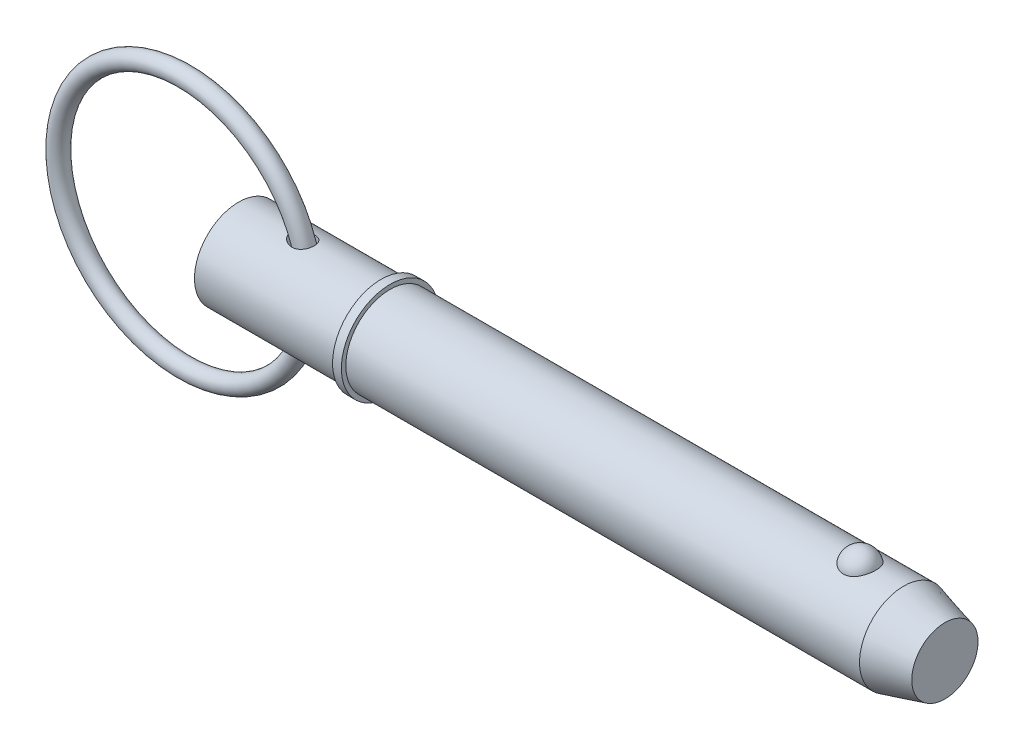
ISO-10303-21;
HEADER;
FILE_DESCRIPTION(('STEP AP214'),'2;1');
FILE_NAME('part.step','',(''),(''),'','','');
FILE_SCHEMA(('AUTOMOTIVE_DESIGN { 1 0 10303 214 1 1 1 1 }'));
ENDSEC;
DATA;
#1=APPLICATION_CONTEXT('core data for automotive mechanical design processes');
#2=APPLICATION_PROTOCOL_DEFINITION('international standard','automotive_design',2000,#1);
#3=PRODUCT_CONTEXT('',#1,'mechanical');
#4=PRODUCT('Part','Part','',(#3));
#5=PRODUCT_RELATED_PRODUCT_CATEGORY('part','',(#4));
#6=PRODUCT_DEFINITION_FORMATION('','',#4);
#7=PRODUCT_DEFINITION_CONTEXT('part definition',#1,'design');
#8=PRODUCT_DEFINITION('design','',#6,#7);
#9=PRODUCT_DEFINITION_SHAPE('','',#8);
#10=(LENGTH_UNIT() NAMED_UNIT(*) SI_UNIT(.MILLI.,.METRE.));
#11=(NAMED_UNIT(*) PLANE_ANGLE_UNIT() SI_UNIT($,.RADIAN.));
#12=(NAMED_UNIT(*) SI_UNIT($,.STERADIAN.) SOLID_ANGLE_UNIT());
#13=UNCERTAINTY_MEASURE_WITH_UNIT(LENGTH_MEASURE(1.E-05),#10,'distance_accuracy_value','');
#14=(GEOMETRIC_REPRESENTATION_CONTEXT(3) GLOBAL_UNCERTAINTY_ASSIGNED_CONTEXT((#13)) GLOBAL_UNIT_ASSIGNED_CONTEXT((#10,
#11,#12)) REPRESENTATION_CONTEXT('',''));
#15=CARTESIAN_POINT('',(0.,0.,0.));
#16=DIRECTION('',(0.,0.,1.));
#17=DIRECTION('',(1.,0.,0.));
#18=AXIS2_PLACEMENT_3D('',#15,#16,#17);
#19=CARTESIAN_POINT('',(-13.640845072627,0.,0.));
#20=DIRECTION('',(0.,0.,1.));
#21=DIRECTION('',(1.,0.,0.));
#22=AXIS2_PLACEMENT_3D('',#19,#20,#21);
#23=TOROIDAL_SURFACE('',#22,31.75,2.223);
#24=CARTESIAN_POINT('',(20.332154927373,0.,0.));
#25=VERTEX_POINT('',#24);
#26=VERTEX_LOOP('',#25);
#27=FACE_BOUND('',#26,.T.);
#28=ADVANCED_FACE('P0_F12',(#27),#23,.T.);
#29=CLOSED_SHELL('',(#28));
#30=MANIFOLD_SOLID_BREP('P0_B1',#29);
#31=CARTESIAN_POINT('',(0.,0.,0.));
#32=DIRECTION('',(1.,0.,0.));
#33=DIRECTION('',(0.,0.,-1.));
#34=AXIS2_PLACEMENT_3D('',#31,#32,#33);
#35=CYLINDRICAL_SURFACE('',#34,11.115);
#36=CARTESIAN_POINT('',(13.5245830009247,11.0328953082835,-1.34849772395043));
#37=CARTESIAN_POINT('',(13.6190616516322,11.0150940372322,-1.49413162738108));
#38=CARTESIAN_POINT('',(13.7272589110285,10.9954577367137,-1.63076546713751));
#39=CARTESIAN_POINT('',(13.9654537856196,10.9550099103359,-1.8834727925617));
#40=CARTESIAN_POINT('',(14.0954990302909,10.9341958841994,-1.99950019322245));
#41=CARTESIAN_POINT('',(14.3718600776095,10.893854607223,-2.20871939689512));
#42=CARTESIAN_POINT('',(14.5180879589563,10.8743212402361,-2.30202655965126));
#43=CARTESIAN_POINT('',(14.8233821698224,10.8385071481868,-2.46515115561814));
#44=CARTESIAN_POINT('',(14.9824448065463,10.8222254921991,-2.53497531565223));
#45=CARTESIAN_POINT('',(15.3233581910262,10.7936101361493,-2.65430007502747));
#46=CARTESIAN_POINT('',(15.5060064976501,10.7817126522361,-2.7016502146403));
#47=CARTESIAN_POINT('',(15.8771124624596,10.7657570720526,-2.76455948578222));
#48=CARTESIAN_POINT('',(16.0655695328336,10.7616981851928,-2.78012182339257));
#49=CARTESIAN_POINT('',(16.4345152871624,10.7624400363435,-2.77724928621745));
#50=CARTESIAN_POINT('',(16.6150121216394,10.7668823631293,-2.76018977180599));
#51=CARTESIAN_POINT('',(16.9695132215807,10.7837407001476,-2.69357457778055));
#52=CARTESIAN_POINT('',(17.1435222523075,10.7961507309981,-2.64404326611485));
#53=CARTESIAN_POINT('',(17.4621418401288,10.8258984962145,-2.51928348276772));
#54=CARTESIAN_POINT('',(17.6079677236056,10.8426430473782,-2.44700611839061));
#55=CARTESIAN_POINT('',(17.884162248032,10.8794194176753,-2.27791740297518));
#56=CARTESIAN_POINT('',(18.0145349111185,10.8994503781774,-2.18111245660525));
#57=CARTESIAN_POINT('',(18.2494965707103,10.9392822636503,-1.9713196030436));
#58=CARTESIAN_POINT('',(18.3550661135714,10.9590421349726,-1.85941863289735));
#59=CARTESIAN_POINT('',(18.5458147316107,10.9970986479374,-1.61919918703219));
#60=CARTESIAN_POINT('',(18.6309947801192,11.0153953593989,-1.49088149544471));
#61=CARTESIAN_POINT('',(18.7786686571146,11.0484675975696,-1.2218388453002));
#62=CARTESIAN_POINT('',(18.8412214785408,11.063252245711,-1.08114735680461));
#63=CARTESIAN_POINT('',(18.9425265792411,11.0877718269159,-0.791025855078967));
#64=CARTESIAN_POINT('',(18.9812780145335,11.0975065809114,-0.641595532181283));
#65=CARTESIAN_POINT('',(19.0343305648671,11.1109435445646,-0.336997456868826));
#66=CARTESIAN_POINT('',(19.0484404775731,11.1145985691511,-0.181794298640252));
#67=CARTESIAN_POINT('',(19.0513147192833,11.1153384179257,0.128864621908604));
#68=CARTESIAN_POINT('',(19.0400783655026,11.112423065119,0.284320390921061));
#69=CARTESIAN_POINT('',(18.9924362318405,11.1003163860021,0.591525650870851));
#70=CARTESIAN_POINT('',(18.9559600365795,11.0911075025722,0.743263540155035));
#71=CARTESIAN_POINT('',(18.858576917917,11.0673920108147,1.0382524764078));
#72=CARTESIAN_POINT('',(18.7976699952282,11.0528854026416,1.18150352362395));
#73=CARTESIAN_POINT('',(18.6529960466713,11.020201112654,1.45511394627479));
#74=CARTESIAN_POINT('',(18.5692772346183,11.0020311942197,1.58549973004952));
#75=CARTESIAN_POINT('',(18.3810003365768,10.9640237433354,1.82995492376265));
#76=CARTESIAN_POINT('',(18.2764441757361,10.9441863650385,1.94402583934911));
#77=CARTESIAN_POINT('',(18.0501398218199,10.9052267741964,2.15183128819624));
#78=CARTESIAN_POINT('',(17.9285270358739,10.8861003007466,2.24571250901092));
#79=CARTESIAN_POINT('',(17.6709592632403,10.8505244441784,2.41175942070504));
#80=CARTESIAN_POINT('',(17.5350055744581,10.8340748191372,2.48392707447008));
#81=CARTESIAN_POINT('',(17.2528390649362,10.8056099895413,2.60497667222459));
#82=CARTESIAN_POINT('',(17.1066353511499,10.7935909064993,2.65387899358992));
#83=CARTESIAN_POINT('',(16.8080326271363,10.7750969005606,2.72799859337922));
#84=CARTESIAN_POINT('',(16.6556326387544,10.7686228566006,2.75321211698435));
#85=CARTESIAN_POINT('',(16.3428877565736,10.761517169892,2.78086153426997));
#86=CARTESIAN_POINT('',(16.1824599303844,10.7611149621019,2.78240297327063));
#87=CARTESIAN_POINT('',(15.863296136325,10.766478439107,2.76156874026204));
#88=CARTESIAN_POINT('',(15.7045607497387,10.7722461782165,2.73918510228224));
#89=CARTESIAN_POINT('',(15.3787211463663,10.7898500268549,2.66904167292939));
#90=CARTESIAN_POINT('',(15.2120794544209,10.8021675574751,2.61925575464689));
#91=CARTESIAN_POINT('',(14.8886284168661,10.8315482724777,2.49496357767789));
#92=CARTESIAN_POINT('',(14.731827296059,10.8486153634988,2.42043695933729));
#93=CARTESIAN_POINT('',(14.4198762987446,10.8870804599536,2.24137362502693));
#94=CARTESIAN_POINT('',(14.2658484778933,10.9087148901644,2.13492229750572));
#95=CARTESIAN_POINT('',(13.9788214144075,10.9526299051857,1.89676517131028));
#96=CARTESIAN_POINT('',(13.8458041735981,10.9749099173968,1.76508120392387));
#97=CARTESIAN_POINT('',(13.6310853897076,11.012885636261,1.50762337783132));
#98=CARTESIAN_POINT('',(13.5444453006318,11.0290026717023,1.38602082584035));
#99=CARTESIAN_POINT('',(13.392158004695,11.0581740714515,1.12983363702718));
#100=CARTESIAN_POINT('',(13.3264946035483,11.0712307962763,0.995259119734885));
#101=CARTESIAN_POINT('',(13.2464179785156,11.0874250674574,0.785640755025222));
#102=CARTESIAN_POINT('',(13.2227369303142,11.0922707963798,0.714166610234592));
#103=CARTESIAN_POINT('',(13.1820656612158,11.1006486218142,0.569277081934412));
#104=CARTESIAN_POINT('',(13.1650721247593,11.1041813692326,0.495862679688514));
#105=CARTESIAN_POINT('',(13.1381118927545,11.1098070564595,0.347711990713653));
#106=CARTESIAN_POINT('',(13.1281436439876,11.1119003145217,0.272975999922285));
#107=CARTESIAN_POINT('',(13.1154243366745,11.1145746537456,0.122890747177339));
#108=CARTESIAN_POINT('',(13.1126723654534,11.1151559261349,0.0475415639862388));
#109=CARTESIAN_POINT('',(13.115160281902,11.1146296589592,-0.160384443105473));
#110=CARTESIAN_POINT('',(13.128061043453,11.111903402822,-0.292944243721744));
#111=CARTESIAN_POINT('',(13.175691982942,11.1019662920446,-0.553751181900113));
#112=CARTESIAN_POINT('',(13.2104121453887,11.094757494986,-0.682000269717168));
#113=CARTESIAN_POINT('',(13.2891255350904,11.0787645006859,-0.901873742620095));
#114=CARTESIAN_POINT('',(13.3290466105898,11.0707438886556,-0.995044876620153));
#115=CARTESIAN_POINT('',(13.4192915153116,11.0529876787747,-1.17599209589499));
#116=CARTESIAN_POINT('',(13.4696154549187,11.0432520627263,-1.26376812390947));
#117=CARTESIAN_POINT('',(13.5245830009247,11.0328953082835,-1.34849772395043));
#118=B_SPLINE_CURVE_WITH_KNOTS('',3,(#36,#37,#38,#39,#40,#41,#42,#43,#44,#45,#46,#47,#48,#49,
#50,#51,#52,#53,#54,#55,#56,#57,#58,#59,#60,#61,#62,#63,#64,#65,#66,#67,#68,#69,#70,#71,#72,#73,
#74,#75,#76,#77,#78,#79,#80,#81,#82,#83,#84,#85,#86,#87,#88,#89,#90,#91,#92,#93,#94,#95,#96,#97,
#98,#99,#100,#101,#102,#103,#104,#105,#106,#107,#108,#109,#110,#111,#112,#113,#114,#115,#116,
#117),.UNSPECIFIED.,.T.,.F.,(4,2,2,2,2,2,2,2,2,2,2,2,2,2,2,2,2,2,2,2,2,2,2,2,2,2,2,2,2,2,2,2,2,
2,2,2,2,2,2,2,4),(0.,0.52309976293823,1.04735506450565,1.56889024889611,2.09027590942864,
2.65465173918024,3.21897064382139,3.76002078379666,4.30066536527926,4.78898318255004,
5.27717362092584,5.74028268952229,6.20336964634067,6.665240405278,7.12712754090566,
7.59258295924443,8.05805091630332,8.52482272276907,8.99159451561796,9.45738731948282,
9.9231371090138,10.3853792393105,10.8475795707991,11.3093743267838,11.7712422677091,
12.2505208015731,12.7299589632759,13.2508366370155,13.7721440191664,14.334890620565,
14.8971525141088,15.3459336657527,15.7943675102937,16.0204422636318,16.2464047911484,
16.4723173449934,16.6982013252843,17.095711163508,17.4930386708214,17.7973741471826,
18.1017128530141),.UNSPECIFIED.);
#119=CARTESIAN_POINT('',(13.5245830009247,11.0328953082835,-1.34849772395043));
#120=VERTEX_POINT('',#119);
#121=EDGE_CURVE('P1_E42',#120,#120,#118,.T.);
#122=ORIENTED_EDGE('',*,*,#121,.T.);
#123=EDGE_LOOP('',(#122));
#124=FACE_BOUND('',#123,.T.);
#125=CARTESIAN_POINT('',(0.,0.,0.));
#126=DIRECTION('',(1.,0.,0.));
#127=DIRECTION('',(0.,0.,-1.));
#128=AXIS2_PLACEMENT_3D('',#125,#126,#127);
#129=CIRCLE('',#128,11.115);
#130=CARTESIAN_POINT('',(0.,0.,-11.115));
#131=VERTEX_POINT('',#130);
#132=EDGE_CURVE('P1_E9',#131,#131,#129,.T.);
#133=ORIENTED_EDGE('',*,*,#132,.T.);
#134=EDGE_LOOP('',(#133));
#135=FACE_BOUND('',#134,.T.);
#136=CARTESIAN_POINT('',(35.877,0.,0.));
#137=DIRECTION('',(1.,0.,0.));
#138=DIRECTION('',(0.,0.,-1.));
#139=AXIS2_PLACEMENT_3D('',#136,#137,#138);
#140=CIRCLE('',#139,11.115);
#141=CARTESIAN_POINT('',(35.877,0.,-11.115));
#142=VERTEX_POINT('',#141);
#143=EDGE_CURVE('P1_E25',#142,#142,#140,.T.);
#144=ORIENTED_EDGE('',*,*,#143,.F.);
#145=EDGE_LOOP('',(#144));
#146=FACE_BOUND('',#145,.T.);
#147=CARTESIAN_POINT('',(13.5245830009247,-11.0328953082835,-1.34849772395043));
#148=CARTESIAN_POINT('',(13.449887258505,-11.0469690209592,-1.233356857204));
#149=CARTESIAN_POINT('',(13.3837464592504,-11.0598986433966,-1.11255897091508));
#150=CARTESIAN_POINT('',(13.271526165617,-11.0822620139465,-0.861680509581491));
#151=CARTESIAN_POINT('',(13.2254273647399,-11.0916991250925,-0.731609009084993));
#152=CARTESIAN_POINT('',(13.1557497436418,-11.1060943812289,-0.464578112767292));
#153=CARTESIAN_POINT('',(13.1322820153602,-11.111030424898,-0.327588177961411));
#154=CARTESIAN_POINT('',(13.1098958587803,-11.1157368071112,-0.0515139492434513));
#155=CARTESIAN_POINT('',(13.1109730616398,-11.1155080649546,0.0875699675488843));
#156=CARTESIAN_POINT('',(13.1367722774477,-11.110088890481,0.354927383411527));
#157=CARTESIAN_POINT('',(13.160070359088,-11.1051972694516,0.483348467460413));
#158=CARTESIAN_POINT('',(13.2268311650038,-11.091413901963,0.734581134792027));
#159=CARTESIAN_POINT('',(13.2702981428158,-11.0825213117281,0.857391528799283));
#160=CARTESIAN_POINT('',(13.3769008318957,-11.0612491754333,1.09871322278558));
#161=CARTESIAN_POINT('',(13.4406446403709,-11.048763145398,1.21694419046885));
#162=CARTESIAN_POINT('',(13.5844860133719,-11.0215642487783,1.44267020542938));
#163=CARTESIAN_POINT('',(13.6645903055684,-11.0068504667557,1.55016080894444));
#164=CARTESIAN_POINT('',(13.8511803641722,-10.9741237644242,1.76795565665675));
#165=CARTESIAN_POINT('',(13.959808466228,-10.9559422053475,1.87639683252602));
#166=CARTESIAN_POINT('',(14.1916437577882,-10.9197998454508,2.07642617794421));
#167=CARTESIAN_POINT('',(14.3148607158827,-10.901839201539,2.16800294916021));
#168=CARTESIAN_POINT('',(14.5931107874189,-10.8649902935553,2.34622033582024));
#169=CARTESIAN_POINT('',(14.7501095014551,-10.8463937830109,2.42986679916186));
#170=CARTESIAN_POINT('',(15.0757118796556,-10.8136392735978,2.57171975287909));
#171=CARTESIAN_POINT('',(15.2443214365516,-10.7994835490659,2.62991321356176));
#172=CARTESIAN_POINT('',(15.599068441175,-10.7767894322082,2.72147498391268));
#173=CARTESIAN_POINT('',(15.7856559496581,-10.768622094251,2.75321798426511));
#174=CARTESIAN_POINT('',(16.1617095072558,-10.7608206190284,2.78356776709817));
#175=CARTESIAN_POINT('',(16.3511739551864,-10.7611818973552,2.78219235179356));
#176=CARTESIAN_POINT('',(16.7138126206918,-10.7705428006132,2.7457129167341));
#177=CARTESIAN_POINT('',(16.8872269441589,-10.7789612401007,2.71287798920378));
#178=CARTESIAN_POINT('',(17.2247245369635,-10.8028011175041,2.61632772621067));
#179=CARTESIAN_POINT('',(17.3888134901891,-10.8182182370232,2.55263143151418));
#180=CARTESIAN_POINT('',(17.6871641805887,-10.8524191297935,2.40281428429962));
#181=CARTESIAN_POINT('',(17.8227812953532,-10.8707652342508,2.31928155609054));
#182=CARTESIAN_POINT('',(18.0770765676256,-10.9094513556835,2.12988301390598));
#183=CARTESIAN_POINT('',(18.1957578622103,-10.9297910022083,2.0240213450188));
#184=CARTESIAN_POINT('',(18.4088055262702,-10.9693230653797,1.79719870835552));
#185=CARTESIAN_POINT('',(18.5038890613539,-10.9885305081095,1.67691225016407));
#186=CARTESIAN_POINT('',(18.6726701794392,-11.0244347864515,1.42183894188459));
#187=CARTESIAN_POINT('',(18.7463681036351,-11.0411316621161,1.28705232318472));
#188=CARTESIAN_POINT('',(18.8708297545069,-11.0702507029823,1.00634471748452));
#189=CARTESIAN_POINT('',(18.9215212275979,-11.0826593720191,0.860390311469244));
#190=CARTESIAN_POINT('',(18.9984973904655,-11.1017993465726,0.561823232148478));
#191=CARTESIAN_POINT('',(19.0247811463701,-11.1085304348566,0.409210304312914));
#192=CARTESIAN_POINT('',(19.0524622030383,-11.1156244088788,0.100537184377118));
#193=CARTESIAN_POINT('',(19.0536873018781,-11.1159432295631,-0.0555394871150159));
#194=CARTESIAN_POINT('',(19.0307837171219,-11.110065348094,-0.365700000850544));
#195=CARTESIAN_POINT('',(19.0066544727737,-11.1038685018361,-0.519783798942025));
#196=CARTESIAN_POINT('',(18.9335163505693,-11.0856111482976,-0.821817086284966));
#197=CARTESIAN_POINT('',(18.88447016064,-11.0735418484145,-0.969757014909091));
#198=CARTESIAN_POINT('',(18.7625929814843,-11.0448501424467,-1.25502066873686));
#199=CARTESIAN_POINT('',(18.6897623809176,-11.0282278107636,-1.39234456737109));
#200=CARTESIAN_POINT('',(18.522359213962,-10.9923333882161,-1.65195905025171));
#201=CARTESIAN_POINT('',(18.427863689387,-10.9730707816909,-1.77430060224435));
#202=CARTESIAN_POINT('',(18.2194216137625,-10.9340072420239,-2.00099176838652));
#203=CARTESIAN_POINT('',(18.1054772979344,-10.9142063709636,-2.10534344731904));
#204=CARTESIAN_POINT('',(17.8622613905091,-10.8764452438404,-2.2924289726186));
#205=CARTESIAN_POINT('',(17.7331196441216,-10.8584715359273,-2.3753290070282));
#206=CARTESIAN_POINT('',(17.4625069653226,-10.8261386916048,-2.51860389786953));
#207=CARTESIAN_POINT('',(17.3210365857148,-10.8117793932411,-2.57897976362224));
#208=CARTESIAN_POINT('',(17.0290309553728,-10.7880576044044,-2.67648805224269));
#209=CARTESIAN_POINT('',(16.8784484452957,-10.7787241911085,-2.71348542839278));
#210=CARTESIAN_POINT('',(16.573148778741,-10.7659618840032,-2.7636855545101));
#211=CARTESIAN_POINT('',(16.4184306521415,-10.7625343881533,-2.77688267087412));
#212=CARTESIAN_POINT('',(16.1008073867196,-10.761643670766,-2.78033419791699));
#213=CARTESIAN_POINT('',(15.9378898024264,-10.7644957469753,-2.76937572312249));
#214=CARTESIAN_POINT('',(15.6157286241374,-10.7762062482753,-2.72344300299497));
#215=CARTESIAN_POINT('',(15.4564861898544,-10.7850665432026,-2.68846128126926));
#216=CARTESIAN_POINT('',(15.1305734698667,-10.808737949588,-2.59174021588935));
#217=CARTESIAN_POINT('',(14.9645834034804,-10.8240246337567,-2.52782071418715));
#218=CARTESIAN_POINT('',(14.6448218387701,-10.8585969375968,-2.37491543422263));
#219=CARTESIAN_POINT('',(14.4910653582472,-10.8778873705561,-2.28589943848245));
#220=CARTESIAN_POINT('',(14.1837929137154,-10.920550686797,-2.07312951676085));
#221=CARTESIAN_POINT('',(14.0321999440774,-10.9441390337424,-1.94661563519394));
#222=CARTESIAN_POINT('',(13.756115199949,-10.9902311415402,-1.66673537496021));
#223=CARTESIAN_POINT('',(13.6315733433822,-11.0127368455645,-1.51341958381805));
#224=CARTESIAN_POINT('',(13.5245830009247,-11.0328953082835,-1.34849772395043));
#225=B_SPLINE_CURVE_WITH_KNOTS('',3,(#147,#148,#149,#150,#151,#152,#153,#154,#155,#156,#157,
#158,#159,#160,#161,#162,#163,#164,#165,#166,#167,#168,#169,#170,#171,#172,#173,#174,#175,#176,
#177,#178,#179,#180,#181,#182,#183,#184,#185,#186,#187,#188,#189,#190,#191,#192,#193,#194,#195,
#196,#197,#198,#199,#200,#201,#202,#203,#204,#205,#206,#207,#208,#209,#210,#211,#212,#213,#214,
#215,#216,#217,#218,#219,#220,#221,#222,#223,#224),.UNSPECIFIED.,.T.,.F.,(4,2,2,2,2,2,2,2,2,2,2,
2,2,2,2,2,2,2,2,2,2,2,2,2,2,2,2,2,2,2,2,2,2,2,2,2,2,2,4),(0.,0.4133945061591,0.8263899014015,
1.24140245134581,1.65634113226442,2.04635967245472,2.43646050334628,2.83958259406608,
3.24287078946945,3.70479277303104,4.16702582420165,4.70130512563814,5.23585761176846,
5.80123945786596,6.36631739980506,6.89348344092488,7.42032464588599,7.8989135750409,
8.37741373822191,8.83881993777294,9.30021877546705,9.76305681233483,10.2259125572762,
10.6919479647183,11.1579936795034,11.6247393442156,12.0914773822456,12.55658073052,
13.0216306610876,13.4829619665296,13.9442725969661,14.408224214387,14.8722856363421,
15.3601762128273,15.8482186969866,16.3815107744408,16.9154477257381,17.5086806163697,
18.1008056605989),.UNSPECIFIED.);
#226=CARTESIAN_POINT('',(13.5245830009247,-11.0328953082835,-1.34849772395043));
#227=VERTEX_POINT('',#226);
#228=EDGE_CURVE('P1_E17',#227,#227,#225,.T.);
#229=ORIENTED_EDGE('',*,*,#228,.T.);
#230=EDGE_LOOP('',(#229));
#231=FACE_BOUND('',#230,.T.);
#232=ADVANCED_FACE('P1_F13',(#124,#135,#146,#231),#35,.T.);
#233=CARTESIAN_POINT('',(0.,0.,0.));
#234=DIRECTION('',(1.,0.,0.));
#235=DIRECTION('',(0.,0.,-1.));
#236=AXIS2_PLACEMENT_3D('',#233,#234,#235);
#237=CYLINDRICAL_SURFACE('',#236,11.115);
#238=CARTESIAN_POINT('',(167.429563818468,0.,0.));
#239=DIRECTION('',(1.,0.,0.));
#240=DIRECTION('',(0.,0.,-1.));
#241=AXIS2_PLACEMENT_3D('',#238,#239,#240);
#242=CIRCLE('',#241,11.115);
#243=CARTESIAN_POINT('',(167.429563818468,0.,-11.115));
#244=VERTEX_POINT('',#243);
#245=EDGE_CURVE('P1_E99',#244,#244,#242,.T.);
#246=ORIENTED_EDGE('',*,*,#245,.F.);
#247=EDGE_LOOP('',(#246));
#248=FACE_BOUND('',#247,.T.);
#249=CARTESIAN_POINT('',(38.1,0.,0.));
#250=DIRECTION('',(1.,0.,0.));
#251=DIRECTION('',(0.,0.,-1.));
#252=AXIS2_PLACEMENT_3D('',#249,#250,#251);
#253=CIRCLE('',#252,11.115);
#254=CARTESIAN_POINT('',(38.1,0.,-11.115));
#255=VERTEX_POINT('',#254);
#256=EDGE_CURVE('P1_E96',#255,#255,#253,.T.);
#257=ORIENTED_EDGE('',*,*,#256,.T.);
#258=EDGE_LOOP('',(#257));
#259=FACE_BOUND('',#258,.T.);
#260=CARTESIAN_POINT('',(156.431068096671,10.3028087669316,4.17077409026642));
#261=CARTESIAN_POINT('',(156.214775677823,10.3028003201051,4.17078240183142));
#262=CARTESIAN_POINT('',(155.998548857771,10.3098895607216,4.1534059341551));
#263=CARTESIAN_POINT('',(155.572540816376,10.3373834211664,4.08449540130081));
#264=CARTESIAN_POINT('',(155.362757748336,10.3577841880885,4.03297121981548));
#265=CARTESIAN_POINT('',(154.955782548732,10.4095237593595,3.89746513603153));
#266=CARTESIAN_POINT('',(154.758572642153,10.4408466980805,3.81353029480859));
#267=CARTESIAN_POINT('',(154.381338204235,10.5110236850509,3.61560339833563));
#268=CARTESIAN_POINT('',(154.201317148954,10.5498792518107,3.50160528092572));
#269=CARTESIAN_POINT('',(153.857684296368,10.6322884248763,3.2429246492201));
#270=CARTESIAN_POINT('',(153.694686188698,10.6759443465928,3.09746040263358));
#271=CARTESIAN_POINT('',(153.394591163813,10.7625291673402,2.78171925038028));
#272=CARTESIAN_POINT('',(153.257499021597,10.8054579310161,2.61143778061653));
#273=CARTESIAN_POINT('',(153.006408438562,10.8881935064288,2.24226695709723));
#274=CARTESIAN_POINT('',(152.893710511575,10.9277761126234,2.04244123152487));
#275=CARTESIAN_POINT('',(152.701777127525,10.997484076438,1.62578254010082));
#276=CARTESIAN_POINT('',(152.622544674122,11.0276085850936,1.40894804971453));
#277=CARTESIAN_POINT('',(152.498303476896,11.0756732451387,0.961250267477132));
#278=CARTESIAN_POINT('',(152.453760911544,11.0934470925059,0.730239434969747));
#279=CARTESIAN_POINT('',(152.401569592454,11.1143331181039,0.263439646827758));
#280=CARTESIAN_POINT('',(152.393920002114,11.1174456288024,0.0276507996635));
#281=CARTESIAN_POINT('',(152.41561056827,11.1087161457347,-0.440729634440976));
#282=CARTESIAN_POINT('',(152.444762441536,11.0969502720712,-0.673331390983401));
#283=CARTESIAN_POINT('',(152.539143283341,11.0597872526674,-1.12996621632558));
#284=CARTESIAN_POINT('',(152.604372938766,11.0343898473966,-1.35399912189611));
#285=CARTESIAN_POINT('',(152.76969844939,10.972515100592,-1.78750286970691));
#286=CARTESIAN_POINT('',(152.86983863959,10.9360236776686,-1.99695478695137));
#287=CARTESIAN_POINT('',(153.102940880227,10.855759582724,-2.39520667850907));
#288=CARTESIAN_POINT('',(153.235905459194,10.8119863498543,-2.58400506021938));
#289=CARTESIAN_POINT('',(153.532407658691,10.7216733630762,-2.93635726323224));
#290=CARTESIAN_POINT('',(153.696056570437,10.675123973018,-3.09981510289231));
#291=CARTESIAN_POINT('',(154.049860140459,10.5846571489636,-3.3959224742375));
#292=CARTESIAN_POINT('',(154.240012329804,10.5407394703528,-3.52857487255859));
#293=CARTESIAN_POINT('',(154.63750141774,10.4616690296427,-3.7564605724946));
#294=CARTESIAN_POINT('',(154.84436705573,10.4263443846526,-3.85245432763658));
#295=CARTESIAN_POINT('',(155.272954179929,10.3675574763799,-4.00798747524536));
#296=CARTESIAN_POINT('',(155.494670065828,10.344090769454,-4.06754052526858));
#297=CARTESIAN_POINT('',(155.934669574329,10.3128282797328,-4.14614314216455));
#298=CARTESIAN_POINT('',(156.152565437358,10.3043040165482,-4.16707833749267));
#299=CARTESIAN_POINT('',(156.58894951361,10.3016771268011,-4.17357158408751));
#300=CARTESIAN_POINT('',(156.807437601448,10.3075716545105,-4.159136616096));
#301=CARTESIAN_POINT('',(157.231744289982,10.3326686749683,-4.0963696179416));
#302=CARTESIAN_POINT('',(157.437745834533,10.3514555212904,-4.04909574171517));
#303=CARTESIAN_POINT('',(157.838576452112,10.399818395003,-3.92320197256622));
#304=CARTESIAN_POINT('',(158.0334046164,10.4293952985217,-3.84457953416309));
#305=CARTESIAN_POINT('',(158.411191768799,10.4969600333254,-3.6561241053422));
#306=CARTESIAN_POINT('',(158.593797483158,10.5351178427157,-3.54564545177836));
#307=CARTESIAN_POINT('',(158.938204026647,10.6154999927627,-3.29718036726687));
#308=CARTESIAN_POINT('',(159.100000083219,10.657725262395,-3.1591876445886));
#309=CARTESIAN_POINT('',(159.406959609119,10.744212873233,-2.85163580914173));
#310=CARTESIAN_POINT('',(159.550891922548,10.7884718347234,-2.68084605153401));
#311=CARTESIAN_POINT('',(159.809237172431,10.872374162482,-2.3172186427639));
#312=CARTESIAN_POINT('',(159.923644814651,10.9120167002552,-2.12437704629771));
#313=CARTESIAN_POINT('',(160.123873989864,10.9838919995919,-1.71516999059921));
#314=CARTESIAN_POINT('',(160.20866178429,11.0158465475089,-1.498248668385));
#315=CARTESIAN_POINT('',(160.34268382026,11.0673523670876,-1.052285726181));
#316=CARTESIAN_POINT('',(160.391917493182,11.086903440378,-0.823243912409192));
#317=CARTESIAN_POINT('',(160.453891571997,11.1116323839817,-0.359087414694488));
#318=CARTESIAN_POINT('',(160.466566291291,11.1167843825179,-0.123962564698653));
#319=CARTESIAN_POINT('',(160.454973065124,11.1121144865,0.34522049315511));
#320=CARTESIAN_POINT('',(160.430705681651,11.1022928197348,0.579278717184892));
#321=CARTESIAN_POINT('',(160.345907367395,11.0687504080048,1.03866534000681));
#322=CARTESIAN_POINT('',(160.285529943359,11.0450885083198,1.26402641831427));
#323=CARTESIAN_POINT('',(160.129853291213,10.9863185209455,1.70076772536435));
#324=CARTESIAN_POINT('',(160.034551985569,10.9512097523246,1.91214712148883));
#325=CARTESIAN_POINT('',(159.810397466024,10.8729733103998,2.31608359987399));
#326=CARTESIAN_POINT('',(159.681380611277,10.8298068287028,2.50854240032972));
#327=CARTESIAN_POINT('',(159.392732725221,10.7401896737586,2.86808766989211));
#328=CARTESIAN_POINT('',(159.233102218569,10.6937390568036,3.03517457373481));
#329=CARTESIAN_POINT('',(158.887534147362,10.6029321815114,3.33857581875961));
#330=CARTESIAN_POINT('',(158.701708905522,10.5585680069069,3.47501541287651));
#331=CARTESIAN_POINT('',(158.307875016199,10.4769321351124,3.71390897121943));
#332=CARTESIAN_POINT('',(158.099863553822,10.439661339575,3.81635861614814));
#333=CARTESIAN_POINT('',(157.654066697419,10.3749407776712,3.98910631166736));
#334=CARTESIAN_POINT('',(157.415234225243,10.3482457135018,4.05700929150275));
#335=CARTESIAN_POINT('',(156.927925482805,10.312188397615,4.14782844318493));
#336=CARTESIAN_POINT('',(156.679453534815,10.3028184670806,4.1707645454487));
#337=CARTESIAN_POINT('',(156.431068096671,10.3028087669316,4.17077409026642));
#338=B_SPLINE_CURVE_WITH_KNOTS('',3,(#260,#261,#262,#263,#264,#265,#266,#267,#268,#269,#270,
#271,#272,#273,#274,#275,#276,#277,#278,#279,#280,#281,#282,#283,#284,#285,#286,#287,#288,#289,
#290,#291,#292,#293,#294,#295,#296,#297,#298,#299,#300,#301,#302,#303,#304,#305,#306,#307,#308,
#309,#310,#311,#312,#313,#314,#315,#316,#317,#318,#319,#320,#321,#322,#323,#324,#325,#326,#327,
#328,#329,#330,#331,#332,#333,#334,#335,#336,#337),.UNSPECIFIED.,.T.,.F.,(4,2,2,2,2,2,2,2,2,2,2,
2,2,2,2,2,2,2,2,2,2,2,2,2,2,2,2,2,2,2,2,2,2,2,2,2,2,2,4),(0.,0.647966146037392,1.29574482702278,
1.9425864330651,2.58955857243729,3.25496465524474,3.9204932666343,4.6156636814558,
5.31089647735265,6.01531821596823,6.71972398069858,7.42054043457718,8.12137023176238,
8.82309331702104,9.52487047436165,10.2292439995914,10.9335519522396,11.6223330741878,
12.31085589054,12.96476640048,13.618547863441,14.2521847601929,14.8858731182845,
15.5334360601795,16.1811472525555,16.8611459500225,17.5412664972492,18.2431855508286,
18.9451158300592,19.6483065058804,20.3514864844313,21.0516982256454,21.7519516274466,
22.4556690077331,23.1593743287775,23.8601491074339,24.561012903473,25.3054529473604,
26.0495629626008),.UNSPECIFIED.);
#339=CARTESIAN_POINT('',(156.431068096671,10.3028087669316,4.17077409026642));
#340=VERTEX_POINT('',#339);
#341=EDGE_CURVE('P1_E34',#340,#340,#338,.T.);
#342=ORIENTED_EDGE('',*,*,#341,.T.);
#343=EDGE_LOOP('',(#342));
#344=FACE_BOUND('',#343,.T.);
#345=ADVANCED_FACE('P1_F46',(#248,#259,#344),#237,.T.);
#346=CARTESIAN_POINT('',(0.,0.,0.));
#347=DIRECTION('',(-1.,0.,0.));
#348=DIRECTION('',(0.,0.,1.));
#349=AXIS2_PLACEMENT_3D('',#346,#347,#348);
#350=PLANE('',#349);
#351=ORIENTED_EDGE('',*,*,#132,.F.);
#352=EDGE_LOOP('',(#351));
#353=FACE_BOUND('',#352,.T.);
#354=ADVANCED_FACE('P1_F15',(#353),#350,.T.);
#355=CARTESIAN_POINT('',(35.877,11.115,0.));
#356=DIRECTION('',(-1.,0.,0.));
#357=DIRECTION('',(0.,0.,1.));
#358=AXIS2_PLACEMENT_3D('',#355,#356,#357);
#359=PLANE('',#358);
#360=ORIENTED_EDGE('',*,*,#143,.T.);
#361=EDGE_LOOP('',(#360));
#362=FACE_BOUND('',#361,.T.);
#363=CARTESIAN_POINT('',(35.877,0.,0.));
#364=DIRECTION('',(1.,0.,0.));
#365=DIRECTION('',(0.,0.,-1.));
#366=AXIS2_PLACEMENT_3D('',#363,#364,#365);
#367=CIRCLE('',#366,12.2265);
#368=CARTESIAN_POINT('',(35.877,0.,-12.2265));
#369=VERTEX_POINT('',#368);
#370=EDGE_CURVE('P1_E30',#369,#369,#367,.T.);
#371=ORIENTED_EDGE('',*,*,#370,.F.);
#372=EDGE_LOOP('',(#371));
#373=FACE_BOUND('',#372,.T.);
#374=ADVANCED_FACE('P1_F81',(#362,#373),#359,.T.);
#375=CARTESIAN_POINT('',(0.,0.,0.));
#376=DIRECTION('',(1.,0.,0.));
#377=DIRECTION('',(0.,0.,-1.));
#378=AXIS2_PLACEMENT_3D('',#375,#376,#377);
#379=CYLINDRICAL_SURFACE('',#378,12.2265);
#380=ORIENTED_EDGE('',*,*,#370,.T.);
#381=EDGE_LOOP('',(#380));
#382=FACE_BOUND('',#381,.T.);
#383=CARTESIAN_POINT('',(38.1,0.,0.));
#384=DIRECTION('',(1.,0.,0.));
#385=DIRECTION('',(0.,0.,-1.));
#386=AXIS2_PLACEMENT_3D('',#383,#384,#385);
#387=CIRCLE('',#386,12.2265);
#388=CARTESIAN_POINT('',(38.1,0.,-12.2265));
#389=VERTEX_POINT('',#388);
#390=EDGE_CURVE('P1_E95',#389,#389,#387,.T.);
#391=ORIENTED_EDGE('',*,*,#390,.F.);
#392=EDGE_LOOP('',(#391));
#393=FACE_BOUND('',#392,.T.);
#394=ADVANCED_FACE('P1_F68',(#382,#393),#379,.T.);
#395=CARTESIAN_POINT('',(38.1,12.2265,0.));
#396=DIRECTION('',(1.,0.,0.));
#397=DIRECTION('',(0.,0.,-1.));
#398=AXIS2_PLACEMENT_3D('',#395,#396,#397);
#399=PLANE('',#398);
#400=ORIENTED_EDGE('',*,*,#390,.T.);
#401=EDGE_LOOP('',(#400));
#402=FACE_BOUND('',#401,.T.);
#403=ORIENTED_EDGE('',*,*,#256,.F.);
#404=EDGE_LOOP('',(#403));
#405=FACE_BOUND('',#404,.T.);
#406=ADVANCED_FACE('P1_F62',(#402,#405),#399,.T.);
#407=CARTESIAN_POINT('',(177.8,0.,0.));
#408=DIRECTION('',(-1.,0.,0.));
#409=DIRECTION('',(0.,0.,1.));
#410=AXIS2_PLACEMENT_3D('',#407,#408,#409);
#411=CONICAL_SURFACE('',#410,8.33625000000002,0.26179938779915);
#412=ORIENTED_EDGE('',*,*,#245,.T.);
#413=EDGE_LOOP('',(#412));
#414=FACE_BOUND('',#413,.T.);
#415=CARTESIAN_POINT('',(177.8,0.,0.));
#416=DIRECTION('',(1.,0.,0.));
#417=DIRECTION('',(0.,0.,-1.));
#418=AXIS2_PLACEMENT_3D('',#415,#416,#417);
#419=CIRCLE('',#418,8.33625000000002);
#420=CARTESIAN_POINT('',(177.8,0.,-8.33625000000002));
#421=VERTEX_POINT('',#420);
#422=EDGE_CURVE('P1_E41',#421,#421,#419,.T.);
#423=ORIENTED_EDGE('',*,*,#422,.F.);
#424=EDGE_LOOP('',(#423));
#425=FACE_BOUND('',#424,.T.);
#426=ADVANCED_FACE('P1_F59',(#414,#425),#411,.T.);
#427=CARTESIAN_POINT('',(177.8,8.33625000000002,0.));
#428=DIRECTION('',(1.,0.,0.));
#429=DIRECTION('',(0.,0.,-1.));
#430=AXIS2_PLACEMENT_3D('',#427,#428,#429);
#431=PLANE('',#430);
#432=ORIENTED_EDGE('',*,*,#422,.T.);
#433=EDGE_LOOP('',(#432));
#434=FACE_BOUND('',#433,.T.);
#435=ADVANCED_FACE('P1_F55',(#434),#431,.T.);
#436=CARTESIAN_POINT('',(156.431068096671,10.0035,0.));
#437=DIRECTION('',(-1.,0.,0.));
#438=DIRECTION('',(0.,1.,0.));
#439=AXIS2_PLACEMENT_3D('',#436,#437,#438);
#440=SPHERICAL_SURFACE('',#439,4.18149999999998);
#441=ORIENTED_EDGE('',*,*,#341,.F.);
#442=EDGE_LOOP('',(#441));
#443=FACE_BOUND('',#442,.T.);
#444=ADVANCED_FACE('P1_F50',(#443),#440,.T.);
#445=CARTESIAN_POINT('',(-13.640845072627,0.,0.));
#446=DIRECTION('',(0.,0.,1.));
#447=DIRECTION('',(1.,0.,0.));
#448=AXIS2_PLACEMENT_3D('',#445,#446,#447);
#449=TOROIDAL_SURFACE('',#448,31.75,2.77875);
#450=ORIENTED_EDGE('',*,*,#228,.F.);
#451=EDGE_LOOP('',(#450));
#452=FACE_BOUND('',#451,.T.);
#453=ORIENTED_EDGE('',*,*,#121,.F.);
#454=EDGE_LOOP('',(#453));
#455=FACE_BOUND('',#454,.T.);
#456=ADVANCED_FACE('P1_F54',(#452,#455),#449,.F.);
#457=CLOSED_SHELL('',(#232,#345,#354,#374,#394,#406,#426,#435,#444,#456));
#458=MANIFOLD_SOLID_BREP('P1_B1',#457);
#459=ADVANCED_BREP_SHAPE_REPRESENTATION('',(#18,#30,#458),#14);
#460=SHAPE_DEFINITION_REPRESENTATION(#9,#459);
ENDSEC;
END-ISO-10303-21;
